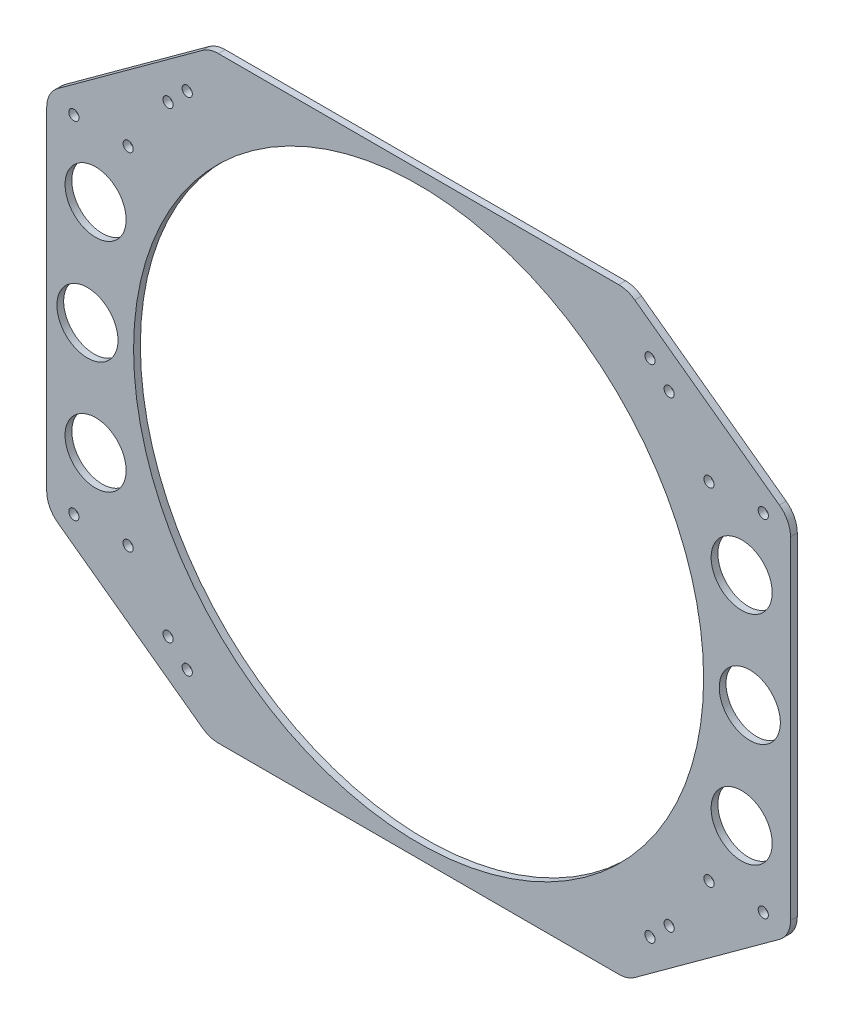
ISO-10303-21;
HEADER;
FILE_DESCRIPTION(('STEP AP214'),'2;1');
FILE_NAME('part.step','',(''),(''),'','','');
FILE_SCHEMA(('AUTOMOTIVE_DESIGN { 1 0 10303 214 1 1 1 1 }'));
ENDSEC;
DATA;
#1=APPLICATION_CONTEXT('core data for automotive mechanical design processes');
#2=APPLICATION_PROTOCOL_DEFINITION('international standard','automotive_design',2000,#1);
#3=PRODUCT_CONTEXT('',#1,'mechanical');
#4=PRODUCT('Part','Part','',(#3));
#5=PRODUCT_RELATED_PRODUCT_CATEGORY('part','',(#4));
#6=PRODUCT_DEFINITION_FORMATION('','',#4);
#7=PRODUCT_DEFINITION_CONTEXT('part definition',#1,'design');
#8=PRODUCT_DEFINITION('design','',#6,#7);
#9=PRODUCT_DEFINITION_SHAPE('','',#8);
#10=(LENGTH_UNIT() NAMED_UNIT(*) SI_UNIT(.MILLI.,.METRE.));
#11=(NAMED_UNIT(*) PLANE_ANGLE_UNIT() SI_UNIT($,.RADIAN.));
#12=(NAMED_UNIT(*) SI_UNIT($,.STERADIAN.) SOLID_ANGLE_UNIT());
#13=UNCERTAINTY_MEASURE_WITH_UNIT(LENGTH_MEASURE(1.E-05),#10,'distance_accuracy_value','');
#14=(GEOMETRIC_REPRESENTATION_CONTEXT(3) GLOBAL_UNCERTAINTY_ASSIGNED_CONTEXT((#13)) GLOBAL_UNIT_ASSIGNED_CONTEXT((#10,
#11,#12)) REPRESENTATION_CONTEXT('',''));
#15=CARTESIAN_POINT('',(0.,0.,0.));
#16=DIRECTION('',(0.,0.,1.));
#17=DIRECTION('',(1.,0.,0.));
#18=AXIS2_PLACEMENT_3D('',#15,#16,#17);
#19=CARTESIAN_POINT('',(-173.99,0.,-3.175));
#20=DIRECTION('',(-1.,0.,0.));
#21=DIRECTION('',(0.,0.,1.));
#22=AXIS2_PLACEMENT_3D('',#19,#20,#21);
#23=PLANE('',#22);
#24=DIRECTION('',(0.,-1.,0.));
#25=VECTOR('',#24,1.);
#26=CARTESIAN_POINT('',(-173.99,0.,0.));
#27=LINE('',#26,#25);
#28=CARTESIAN_POINT('',(-173.99,-61.9606088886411,0.));
#29=VERTEX_POINT('',#28);
#30=CARTESIAN_POINT('',(-173.99,-217.439391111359,0.));
#31=VERTEX_POINT('',#30);
#32=EDGE_CURVE('E205',#29,#31,#27,.T.);
#33=ORIENTED_EDGE('',*,*,#32,.F.);
#34=DIRECTION('',(0.,0.,-1.));
#35=VECTOR('',#34,1.);
#36=CARTESIAN_POINT('',(-173.99,-61.9606088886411,-3.175));
#37=LINE('',#36,#35);
#38=CARTESIAN_POINT('',(-173.99,-61.9606088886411,-3.175));
#39=VERTEX_POINT('',#38);
#40=EDGE_CURVE('E282',#29,#39,#37,.T.);
#41=ORIENTED_EDGE('',*,*,#40,.T.);
#42=DIRECTION('',(0.,-1.,0.));
#43=VECTOR('',#42,1.);
#44=CARTESIAN_POINT('',(-173.99,0.,-3.175));
#45=LINE('',#44,#43);
#46=CARTESIAN_POINT('',(-173.99,-217.439391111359,-3.175));
#47=VERTEX_POINT('',#46);
#48=EDGE_CURVE('E208',#39,#47,#45,.T.);
#49=ORIENTED_EDGE('',*,*,#48,.T.);
#50=DIRECTION('',(0.,0.,-1.));
#51=VECTOR('',#50,1.);
#52=CARTESIAN_POINT('',(-173.99,-217.439391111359,0.));
#53=LINE('',#52,#51);
#54=EDGE_CURVE('E280',#47,#31,#53,.F.);
#55=ORIENTED_EDGE('',*,*,#54,.T.);
#56=EDGE_LOOP('',(#33,#41,#49,#55));
#57=FACE_BOUND('',#56,.T.);
#58=ADVANCED_FACE('F37',(#57),#23,.T.);
#59=CARTESIAN_POINT('',(-173.99,0.,-3.175));
#60=DIRECTION('',(0.,1.,0.));
#61=DIRECTION('',(-1.,0.,0.));
#62=AXIS2_PLACEMENT_3D('',#59,#60,#61);
#63=PLANE('',#62);
#64=DIRECTION('',(-1.,0.,0.));
#65=VECTOR('',#64,1.);
#66=CARTESIAN_POINT('',(-173.99,0.,0.));
#67=LINE('',#66,#65);
#68=CARTESIAN_POINT('',(93.655296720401,0.,0.));
#69=VERTEX_POINT('',#68);
#70=CARTESIAN_POINT('',(-93.6552967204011,0.,0.));
#71=VERTEX_POINT('',#70);
#72=EDGE_CURVE('E212',#69,#71,#67,.T.);
#73=ORIENTED_EDGE('',*,*,#72,.F.);
#74=DIRECTION('',(0.,0.,-1.));
#75=VECTOR('',#74,1.);
#76=CARTESIAN_POINT('',(93.655296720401,0.,-3.175));
#77=LINE('',#76,#75);
#78=CARTESIAN_POINT('',(93.655296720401,0.,-3.175));
#79=VERTEX_POINT('',#78);
#80=EDGE_CURVE('E272',#69,#79,#77,.T.);
#81=ORIENTED_EDGE('',*,*,#80,.T.);
#82=DIRECTION('',(-1.,0.,0.));
#83=VECTOR('',#82,1.);
#84=CARTESIAN_POINT('',(-173.99,0.,-3.175));
#85=LINE('',#84,#83);
#86=CARTESIAN_POINT('',(-93.6552967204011,0.,-3.175));
#87=VERTEX_POINT('',#86);
#88=EDGE_CURVE('E217',#79,#87,#85,.T.);
#89=ORIENTED_EDGE('',*,*,#88,.T.);
#90=DIRECTION('',(0.,0.,-1.));
#91=VECTOR('',#90,1.);
#92=CARTESIAN_POINT('',(-93.6552967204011,0.,0.));
#93=LINE('',#92,#91);
#94=EDGE_CURVE('E270',#87,#71,#93,.F.);
#95=ORIENTED_EDGE('',*,*,#94,.T.);
#96=EDGE_LOOP('',(#73,#81,#89,#95));
#97=FACE_BOUND('',#96,.T.);
#98=ADVANCED_FACE('F322',(#97),#63,.T.);
#99=CARTESIAN_POINT('',(173.99,-279.4,-3.175));
#100=DIRECTION('',(1.,0.,0.));
#101=DIRECTION('',(0.,1.,0.));
#102=AXIS2_PLACEMENT_3D('',#99,#100,#101);
#103=PLANE('',#102);
#104=DIRECTION('',(0.,1.,0.));
#105=VECTOR('',#104,1.);
#106=CARTESIAN_POINT('',(173.99,-279.4,0.));
#107=LINE('',#106,#105);
#108=CARTESIAN_POINT('',(173.99,-217.439391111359,0.));
#109=VERTEX_POINT('',#108);
#110=CARTESIAN_POINT('',(173.99,-61.9606088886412,0.));
#111=VERTEX_POINT('',#110);
#112=EDGE_CURVE('E224',#109,#111,#107,.T.);
#113=ORIENTED_EDGE('',*,*,#112,.F.);
#114=DIRECTION('',(0.,0.,-1.));
#115=VECTOR('',#114,1.);
#116=CARTESIAN_POINT('',(173.99,-217.439391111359,-3.175));
#117=LINE('',#116,#115);
#118=CARTESIAN_POINT('',(173.99,-217.439391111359,-3.175));
#119=VERTEX_POINT('',#118);
#120=EDGE_CURVE('E262',#109,#119,#117,.T.);
#121=ORIENTED_EDGE('',*,*,#120,.T.);
#122=DIRECTION('',(0.,1.,0.));
#123=VECTOR('',#122,1.);
#124=CARTESIAN_POINT('',(173.99,-279.4,-3.175));
#125=LINE('',#124,#123);
#126=CARTESIAN_POINT('',(173.99,-61.9606088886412,-3.175));
#127=VERTEX_POINT('',#126);
#128=EDGE_CURVE('E214',#119,#127,#125,.T.);
#129=ORIENTED_EDGE('',*,*,#128,.T.);
#130=DIRECTION('',(0.,0.,-1.));
#131=VECTOR('',#130,1.);
#132=CARTESIAN_POINT('',(173.99,-61.9606088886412,0.));
#133=LINE('',#132,#131);
#134=EDGE_CURVE('E260',#127,#111,#133,.F.);
#135=ORIENTED_EDGE('',*,*,#134,.T.);
#136=EDGE_LOOP('',(#113,#121,#129,#135));
#137=FACE_BOUND('',#136,.T.);
#138=ADVANCED_FACE('F304',(#137),#103,.T.);
#139=CARTESIAN_POINT('',(173.99,-279.4,-3.175));
#140=DIRECTION('',(0.,-1.,0.));
#141=DIRECTION('',(1.,0.,0.));
#142=AXIS2_PLACEMENT_3D('',#139,#140,#141);
#143=PLANE('',#142);
#144=DIRECTION('',(1.,0.,0.));
#145=VECTOR('',#144,1.);
#146=CARTESIAN_POINT('',(173.99,-279.4,-3.175));
#147=LINE('',#146,#145);
#148=CARTESIAN_POINT('',(-93.655296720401,-279.4,-3.175));
#149=VERTEX_POINT('',#148);
#150=CARTESIAN_POINT('',(93.655296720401,-279.4,-3.175));
#151=VERTEX_POINT('',#150);
#152=EDGE_CURVE('E211',#149,#151,#147,.T.);
#153=ORIENTED_EDGE('',*,*,#152,.T.);
#154=DIRECTION('',(0.,0.,-1.));
#155=VECTOR('',#154,1.);
#156=CARTESIAN_POINT('',(93.655296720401,-279.4,0.));
#157=LINE('',#156,#155);
#158=CARTESIAN_POINT('',(93.655296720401,-279.4,0.));
#159=VERTEX_POINT('',#158);
#160=EDGE_CURVE('E155',#151,#159,#157,.F.);
#161=ORIENTED_EDGE('',*,*,#160,.T.);
#162=DIRECTION('',(1.,0.,0.));
#163=VECTOR('',#162,1.);
#164=CARTESIAN_POINT('',(173.99,-279.4,0.));
#165=LINE('',#164,#163);
#166=CARTESIAN_POINT('',(-93.655296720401,-279.4,0.));
#167=VERTEX_POINT('',#166);
#168=EDGE_CURVE('E221',#167,#159,#165,.T.);
#169=ORIENTED_EDGE('',*,*,#168,.F.);
#170=DIRECTION('',(0.,0.,-1.));
#171=VECTOR('',#170,1.);
#172=CARTESIAN_POINT('',(-93.655296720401,-279.4,-3.175));
#173=LINE('',#172,#171);
#174=EDGE_CURVE('E160',#167,#149,#173,.T.);
#175=ORIENTED_EDGE('',*,*,#174,.T.);
#176=EDGE_LOOP('',(#153,#161,#169,#175));
#177=FACE_BOUND('',#176,.T.);
#178=ADVANCED_FACE('F296',(#177),#143,.T.);
#179=CARTESIAN_POINT('',(0.,0.,-3.175));
#180=DIRECTION('',(0.,0.,-1.));
#181=DIRECTION('',(-1.,0.,0.));
#182=AXIS2_PLACEMENT_3D('',#179,#180,#181);
#183=PLANE('',#182);
#184=CARTESIAN_POINT('',(151.13,-88.8999999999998,-3.175));
#185=DIRECTION('',(0.,0.,1.));
#186=DIRECTION('',(-1.,0.,0.));
#187=AXIS2_PLACEMENT_3D('',#184,#185,#186);
#188=CIRCLE('',#187,14.2875);
#189=CARTESIAN_POINT('',(136.8425,-88.8999999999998,-3.175));
#190=VERTEX_POINT('',#189);
#191=EDGE_CURVE('E775',#190,#190,#188,.T.);
#192=ORIENTED_EDGE('',*,*,#191,.T.);
#193=EDGE_LOOP('',(#192));
#194=FACE_BOUND('',#193,.T.);
#195=CARTESIAN_POINT('',(154.94,-139.7,-3.175));
#196=DIRECTION('',(0.,0.,1.));
#197=DIRECTION('',(-1.,0.,0.));
#198=AXIS2_PLACEMENT_3D('',#195,#196,#197);
#199=CIRCLE('',#198,14.2875);
#200=CARTESIAN_POINT('',(140.6525,-139.7,-3.175));
#201=VERTEX_POINT('',#200);
#202=EDGE_CURVE('E779',#201,#201,#199,.T.);
#203=ORIENTED_EDGE('',*,*,#202,.T.);
#204=EDGE_LOOP('',(#203));
#205=FACE_BOUND('',#204,.T.);
#206=CARTESIAN_POINT('',(151.13,-190.5,-3.175));
#207=DIRECTION('',(0.,0.,1.));
#208=DIRECTION('',(-1.,0.,0.));
#209=AXIS2_PLACEMENT_3D('',#206,#207,#208);
#210=CIRCLE('',#209,14.2875);
#211=CARTESIAN_POINT('',(136.8425,-190.5,-3.175));
#212=VERTEX_POINT('',#211);
#213=EDGE_CURVE('E783',#212,#212,#210,.T.);
#214=ORIENTED_EDGE('',*,*,#213,.T.);
#215=EDGE_LOOP('',(#214));
#216=FACE_BOUND('',#215,.T.);
#217=CARTESIAN_POINT('',(-151.13,-190.5,-3.175));
#218=DIRECTION('',(0.,0.,1.));
#219=DIRECTION('',(1.,0.,0.));
#220=AXIS2_PLACEMENT_3D('',#217,#218,#219);
#221=CIRCLE('',#220,14.2875);
#222=CARTESIAN_POINT('',(-136.8425,-190.5,-3.175));
#223=VERTEX_POINT('',#222);
#224=EDGE_CURVE('E787',#223,#223,#221,.T.);
#225=ORIENTED_EDGE('',*,*,#224,.T.);
#226=EDGE_LOOP('',(#225));
#227=FACE_BOUND('',#226,.T.);
#228=CARTESIAN_POINT('',(-154.94,-139.7,-3.175));
#229=DIRECTION('',(0.,0.,1.));
#230=DIRECTION('',(1.,0.,0.));
#231=AXIS2_PLACEMENT_3D('',#228,#229,#230);
#232=CIRCLE('',#231,14.2875);
#233=CARTESIAN_POINT('',(-140.6525,-139.7,-3.175));
#234=VERTEX_POINT('',#233);
#235=EDGE_CURVE('E791',#234,#234,#232,.T.);
#236=ORIENTED_EDGE('',*,*,#235,.T.);
#237=EDGE_LOOP('',(#236));
#238=FACE_BOUND('',#237,.T.);
#239=CARTESIAN_POINT('',(-151.13,-88.8999999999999,-3.175));
#240=DIRECTION('',(0.,0.,1.));
#241=DIRECTION('',(1.,0.,0.));
#242=AXIS2_PLACEMENT_3D('',#239,#240,#241);
#243=CIRCLE('',#242,14.2875);
#244=CARTESIAN_POINT('',(-136.8425,-88.8999999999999,-3.175));
#245=VERTEX_POINT('',#244);
#246=EDGE_CURVE('E795',#245,#245,#243,.T.);
#247=ORIENTED_EDGE('',*,*,#246,.T.);
#248=EDGE_LOOP('',(#247));
#249=FACE_BOUND('',#248,.T.);
#250=CARTESIAN_POINT('',(108.243517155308,-256.923773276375,-3.175));
#251=DIRECTION('',(0.,0.,-1.));
#252=DIRECTION('',(0.,1.,0.));
#253=AXIS2_PLACEMENT_3D('',#250,#251,#252);
#254=CIRCLE('',#253,2.38125000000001);
#255=CARTESIAN_POINT('',(108.243517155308,-254.542523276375,-3.175));
#256=VERTEX_POINT('',#255);
#257=EDGE_CURVE('E799',#256,#256,#254,.T.);
#258=ORIENTED_EDGE('',*,*,#257,.F.);
#259=EDGE_LOOP('',(#258));
#260=FACE_BOUND('',#259,.T.);
#261=CARTESIAN_POINT('',(117.223773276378,-247.943517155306,-3.175));
#262=DIRECTION('',(0.,0.,-1.));
#263=DIRECTION('',(0.,1.,0.));
#264=AXIS2_PLACEMENT_3D('',#261,#262,#263);
#265=CIRCLE('',#264,2.38125000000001);
#266=CARTESIAN_POINT('',(117.223773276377,-245.562267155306,-3.175));
#267=VERTEX_POINT('',#266);
#268=EDGE_CURVE('E803',#267,#267,#265,.T.);
#269=ORIENTED_EDGE('',*,*,#268,.F.);
#270=EDGE_LOOP('',(#269));
#271=FACE_BOUND('',#270,.T.);
#272=CARTESIAN_POINT('',(-117.223773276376,-247.943517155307,-3.175));
#273=DIRECTION('',(0.,0.,-1.));
#274=DIRECTION('',(1.,0.,0.));
#275=AXIS2_PLACEMENT_3D('',#272,#273,#274);
#276=CIRCLE('',#275,2.38125000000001);
#277=CARTESIAN_POINT('',(-114.842523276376,-247.943517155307,-3.175));
#278=VERTEX_POINT('',#277);
#279=EDGE_CURVE('E807',#278,#278,#276,.T.);
#280=ORIENTED_EDGE('',*,*,#279,.F.);
#281=EDGE_LOOP('',(#280));
#282=FACE_BOUND('',#281,.T.);
#283=CARTESIAN_POINT('',(-108.243517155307,-256.923773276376,-3.175));
#284=DIRECTION('',(0.,0.,-1.));
#285=DIRECTION('',(1.,0.,0.));
#286=AXIS2_PLACEMENT_3D('',#283,#284,#285);
#287=CIRCLE('',#286,2.38125000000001);
#288=CARTESIAN_POINT('',(-105.862267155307,-256.923773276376,-3.175));
#289=VERTEX_POINT('',#288);
#290=EDGE_CURVE('E811',#289,#289,#287,.T.);
#291=ORIENTED_EDGE('',*,*,#290,.F.);
#292=EDGE_LOOP('',(#291));
#293=FACE_BOUND('',#292,.T.);
#294=CARTESIAN_POINT('',(-108.243517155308,-22.4762267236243,-3.175));
#295=DIRECTION('',(0.,0.,-1.));
#296=DIRECTION('',(0.,-1.,0.));
#297=AXIS2_PLACEMENT_3D('',#294,#295,#296);
#298=CIRCLE('',#297,2.38125000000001);
#299=CARTESIAN_POINT('',(-108.243517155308,-24.8574767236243,-3.175));
#300=VERTEX_POINT('',#299);
#301=EDGE_CURVE('E815',#300,#300,#298,.T.);
#302=ORIENTED_EDGE('',*,*,#301,.F.);
#303=EDGE_LOOP('',(#302));
#304=FACE_BOUND('',#303,.T.);
#305=CARTESIAN_POINT('',(-117.223773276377,-31.4564828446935,-3.175));
#306=DIRECTION('',(0.,0.,-1.));
#307=DIRECTION('',(0.,-1.,0.));
#308=AXIS2_PLACEMENT_3D('',#305,#306,#307);
#309=CIRCLE('',#308,2.38125000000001);
#310=CARTESIAN_POINT('',(-117.223773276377,-33.8377328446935,-3.175));
#311=VERTEX_POINT('',#310);
#312=EDGE_CURVE('E819',#311,#311,#309,.T.);
#313=ORIENTED_EDGE('',*,*,#312,.F.);
#314=EDGE_LOOP('',(#313));
#315=FACE_BOUND('',#314,.T.);
#316=CARTESIAN_POINT('',(117.223773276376,-31.4564828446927,-3.175));
#317=DIRECTION('',(0.,0.,-1.));
#318=DIRECTION('',(-1.,0.,0.));
#319=AXIS2_PLACEMENT_3D('',#316,#317,#318);
#320=CIRCLE('',#319,2.38125000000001);
#321=CARTESIAN_POINT('',(114.842523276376,-31.4564828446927,-3.175));
#322=VERTEX_POINT('',#321);
#323=EDGE_CURVE('E823',#322,#322,#320,.T.);
#324=ORIENTED_EDGE('',*,*,#323,.F.);
#325=EDGE_LOOP('',(#324));
#326=FACE_BOUND('',#325,.T.);
#327=CARTESIAN_POINT('',(108.243517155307,-22.4762267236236,-3.175));
#328=DIRECTION('',(0.,0.,-1.));
#329=DIRECTION('',(-1.,0.,0.));
#330=AXIS2_PLACEMENT_3D('',#327,#328,#329);
#331=CIRCLE('',#330,2.38125000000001);
#332=CARTESIAN_POINT('',(105.862267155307,-22.4762267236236,-3.175));
#333=VERTEX_POINT('',#332);
#334=EDGE_CURVE('E827',#333,#333,#331,.T.);
#335=ORIENTED_EDGE('',*,*,#334,.F.);
#336=EDGE_LOOP('',(#335));
#337=FACE_BOUND('',#336,.T.);
#338=CARTESIAN_POINT('',(161.260000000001,-220.472,-3.175));
#339=DIRECTION('',(0.,0.,-1.));
#340=DIRECTION('',(-1.,0.,0.));
#341=AXIS2_PLACEMENT_3D('',#338,#339,#340);
#342=CIRCLE('',#341,2.38125);
#343=CARTESIAN_POINT('',(158.878750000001,-220.472,-3.175));
#344=VERTEX_POINT('',#343);
#345=EDGE_CURVE('E831',#344,#344,#342,.T.);
#346=ORIENTED_EDGE('',*,*,#345,.F.);
#347=EDGE_LOOP('',(#346));
#348=FACE_BOUND('',#347,.T.);
#349=CARTESIAN_POINT('',(135.860000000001,-220.472,-3.175));
#350=DIRECTION('',(0.,0.,-1.));
#351=DIRECTION('',(-1.,0.,0.));
#352=AXIS2_PLACEMENT_3D('',#349,#350,#351);
#353=CIRCLE('',#352,2.38125);
#354=CARTESIAN_POINT('',(133.478750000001,-220.472,-3.175));
#355=VERTEX_POINT('',#354);
#356=EDGE_CURVE('E835',#355,#355,#353,.T.);
#357=ORIENTED_EDGE('',*,*,#356,.F.);
#358=EDGE_LOOP('',(#357));
#359=FACE_BOUND('',#358,.T.);
#360=CARTESIAN_POINT('',(161.260000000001,-58.674,-3.175));
#361=DIRECTION('',(0.,0.,-1.));
#362=DIRECTION('',(-1.,0.,0.));
#363=AXIS2_PLACEMENT_3D('',#360,#361,#362);
#364=CIRCLE('',#363,2.38125);
#365=CARTESIAN_POINT('',(158.878750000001,-58.674,-3.175));
#366=VERTEX_POINT('',#365);
#367=EDGE_CURVE('E839',#366,#366,#364,.T.);
#368=ORIENTED_EDGE('',*,*,#367,.F.);
#369=EDGE_LOOP('',(#368));
#370=FACE_BOUND('',#369,.T.);
#371=CARTESIAN_POINT('',(135.860000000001,-58.674,-3.175));
#372=DIRECTION('',(0.,0.,-1.));
#373=DIRECTION('',(-1.,0.,0.));
#374=AXIS2_PLACEMENT_3D('',#371,#372,#373);
#375=CIRCLE('',#374,2.38125);
#376=CARTESIAN_POINT('',(133.478750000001,-58.674,-3.175));
#377=VERTEX_POINT('',#376);
#378=EDGE_CURVE('E843',#377,#377,#375,.T.);
#379=ORIENTED_EDGE('',*,*,#378,.F.);
#380=EDGE_LOOP('',(#379));
#381=FACE_BOUND('',#380,.T.);
#382=CARTESIAN_POINT('',(-161.289999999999,-58.674,-3.175));
#383=DIRECTION('',(0.,0.,-1.));
#384=DIRECTION('',(-1.,0.,0.));
#385=AXIS2_PLACEMENT_3D('',#382,#383,#384);
#386=CIRCLE('',#385,2.38125);
#387=CARTESIAN_POINT('',(-163.671249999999,-58.674,-3.175));
#388=VERTEX_POINT('',#387);
#389=EDGE_CURVE('E847',#388,#388,#386,.T.);
#390=ORIENTED_EDGE('',*,*,#389,.F.);
#391=EDGE_LOOP('',(#390));
#392=FACE_BOUND('',#391,.T.);
#393=CARTESIAN_POINT('',(-135.889999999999,-58.674,-3.175));
#394=DIRECTION('',(0.,0.,-1.));
#395=DIRECTION('',(-1.,0.,0.));
#396=AXIS2_PLACEMENT_3D('',#393,#394,#395);
#397=CIRCLE('',#396,2.38125);
#398=CARTESIAN_POINT('',(-138.271249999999,-58.674,-3.175));
#399=VERTEX_POINT('',#398);
#400=EDGE_CURVE('E851',#399,#399,#397,.T.);
#401=ORIENTED_EDGE('',*,*,#400,.F.);
#402=EDGE_LOOP('',(#401));
#403=FACE_BOUND('',#402,.T.);
#404=CARTESIAN_POINT('',(-135.889999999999,-220.472,-3.175));
#405=DIRECTION('',(0.,0.,-1.));
#406=DIRECTION('',(-1.,0.,0.));
#407=AXIS2_PLACEMENT_3D('',#404,#405,#406);
#408=CIRCLE('',#407,2.38125);
#409=CARTESIAN_POINT('',(-138.271249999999,-220.472,-3.175));
#410=VERTEX_POINT('',#409);
#411=EDGE_CURVE('E855',#410,#410,#408,.T.);
#412=ORIENTED_EDGE('',*,*,#411,.F.);
#413=EDGE_LOOP('',(#412));
#414=FACE_BOUND('',#413,.T.);
#415=CARTESIAN_POINT('',(-161.289999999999,-220.472,-3.175));
#416=DIRECTION('',(0.,0.,-1.));
#417=DIRECTION('',(-1.,0.,0.));
#418=AXIS2_PLACEMENT_3D('',#415,#416,#417);
#419=CIRCLE('',#418,2.38125);
#420=CARTESIAN_POINT('',(-163.671249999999,-220.472,-3.175));
#421=VERTEX_POINT('',#420);
#422=EDGE_CURVE('E182',#421,#421,#419,.T.);
#423=ORIENTED_EDGE('',*,*,#422,.F.);
#424=EDGE_LOOP('',(#423));
#425=FACE_BOUND('',#424,.T.);
#426=DIRECTION('',(0.808328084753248,0.588732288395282,0.));
#427=VECTOR('',#426,1.);
#428=CARTESIAN_POINT('',(173.99,-223.901,-3.175));
#429=LINE('',#428,#427);
#430=CARTESIAN_POINT('',(101.132196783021,-276.965766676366,-3.175));
#431=VERTEX_POINT('',#430);
#432=CARTESIAN_POINT('',(168.76690006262,-227.705157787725,-3.175));
#433=VERTEX_POINT('',#432);
#434=EDGE_CURVE('E167',#431,#433,#429,.T.);
#435=ORIENTED_EDGE('',*,*,#434,.F.);
#436=CARTESIAN_POINT('',(93.655296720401,-266.7,-3.175));
#437=DIRECTION('',(0.,0.,-1.));
#438=DIRECTION('',(-1.,0.,0.));
#439=AXIS2_PLACEMENT_3D('',#436,#437,#438);
#440=CIRCLE('',#439,12.7);
#441=EDGE_CURVE('E150',#431,#151,#440,.T.);
#442=ORIENTED_EDGE('',*,*,#441,.T.);
#443=ORIENTED_EDGE('',*,*,#152,.F.);
#444=CARTESIAN_POINT('',(-93.655296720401,-266.7,-3.175));
#445=DIRECTION('',(0.,0.,-1.));
#446=DIRECTION('',(-1.,0.,0.));
#447=AXIS2_PLACEMENT_3D('',#444,#445,#446);
#448=CIRCLE('',#447,12.7);
#449=CARTESIAN_POINT('',(-101.132196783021,-276.965766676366,-3.175));
#450=VERTEX_POINT('',#449);
#451=EDGE_CURVE('E231',#149,#450,#448,.T.);
#452=ORIENTED_EDGE('',*,*,#451,.T.);
#453=DIRECTION('',(0.808328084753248,-0.588732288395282,0.));
#454=VECTOR('',#453,1.);
#455=CARTESIAN_POINT('',(-173.99,-223.901,-3.175));
#456=LINE('',#455,#454);
#457=CARTESIAN_POINT('',(-168.76690006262,-227.705157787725,-3.175));
#458=VERTEX_POINT('',#457);
#459=EDGE_CURVE('E179',#458,#450,#456,.T.);
#460=ORIENTED_EDGE('',*,*,#459,.F.);
#461=CARTESIAN_POINT('',(-161.29,-217.439391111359,-3.175));
#462=DIRECTION('',(0.,0.,-1.));
#463=DIRECTION('',(-1.,0.,0.));
#464=AXIS2_PLACEMENT_3D('',#461,#462,#463);
#465=CIRCLE('',#464,12.7);
#466=EDGE_CURVE('E171',#458,#47,#465,.T.);
#467=ORIENTED_EDGE('',*,*,#466,.T.);
#468=ORIENTED_EDGE('',*,*,#48,.F.);
#469=CARTESIAN_POINT('',(-161.29,-61.9606088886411,-3.175));
#470=DIRECTION('',(0.,0.,-1.));
#471=DIRECTION('',(-1.,0.,0.));
#472=AXIS2_PLACEMENT_3D('',#469,#470,#471);
#473=CIRCLE('',#472,12.7);
#474=CARTESIAN_POINT('',(-168.76690006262,-51.6948422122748,-3.175));
#475=VERTEX_POINT('',#474);
#476=EDGE_CURVE('E233',#39,#475,#473,.T.);
#477=ORIENTED_EDGE('',*,*,#476,.T.);
#478=DIRECTION('',(-0.808328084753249,-0.588732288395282,0.));
#479=VECTOR('',#478,1.);
#480=CARTESIAN_POINT('',(-173.99,-55.4989999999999,-3.175));
#481=LINE('',#480,#479);
#482=CARTESIAN_POINT('',(-101.132196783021,-2.43423332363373,-3.175));
#483=VERTEX_POINT('',#482);
#484=EDGE_CURVE('E188',#483,#475,#481,.T.);
#485=ORIENTED_EDGE('',*,*,#484,.F.);
#486=CARTESIAN_POINT('',(-93.6552967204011,-12.7,-3.175));
#487=DIRECTION('',(0.,0.,-1.));
#488=DIRECTION('',(-1.,0.,0.));
#489=AXIS2_PLACEMENT_3D('',#486,#487,#488);
#490=CIRCLE('',#489,12.7);
#491=EDGE_CURVE('E235',#483,#87,#490,.T.);
#492=ORIENTED_EDGE('',*,*,#491,.T.);
#493=ORIENTED_EDGE('',*,*,#88,.F.);
#494=CARTESIAN_POINT('',(93.655296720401,-12.7,-3.175));
#495=DIRECTION('',(0.,0.,-1.));
#496=DIRECTION('',(-1.,0.,0.));
#497=AXIS2_PLACEMENT_3D('',#494,#495,#496);
#498=CIRCLE('',#497,12.7);
#499=CARTESIAN_POINT('',(101.132196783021,-2.4342333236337,-3.175));
#500=VERTEX_POINT('',#499);
#501=EDGE_CURVE('E237',#79,#500,#498,.T.);
#502=ORIENTED_EDGE('',*,*,#501,.T.);
#503=DIRECTION('',(-0.808328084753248,0.588732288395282,0.));
#504=VECTOR('',#503,1.);
#505=CARTESIAN_POINT('',(173.99,-55.4989999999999,-3.175));
#506=LINE('',#505,#504);
#507=CARTESIAN_POINT('',(168.76690006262,-51.6948422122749,-3.175));
#508=VERTEX_POINT('',#507);
#509=EDGE_CURVE('E193',#508,#500,#506,.T.);
#510=ORIENTED_EDGE('',*,*,#509,.F.);
#511=CARTESIAN_POINT('',(161.29,-61.9606088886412,-3.175));
#512=DIRECTION('',(0.,0.,-1.));
#513=DIRECTION('',(-1.,0.,0.));
#514=AXIS2_PLACEMENT_3D('',#511,#512,#513);
#515=CIRCLE('',#514,12.7);
#516=EDGE_CURVE('E239',#508,#127,#515,.T.);
#517=ORIENTED_EDGE('',*,*,#516,.T.);
#518=ORIENTED_EDGE('',*,*,#128,.F.);
#519=CARTESIAN_POINT('',(161.29,-217.439391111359,-3.175));
#520=DIRECTION('',(0.,0.,-1.));
#521=DIRECTION('',(-1.,0.,0.));
#522=AXIS2_PLACEMENT_3D('',#519,#520,#521);
#523=CIRCLE('',#522,12.7);
#524=EDGE_CURVE('E161',#119,#433,#523,.T.);
#525=ORIENTED_EDGE('',*,*,#524,.T.);
#526=EDGE_LOOP('',(#435,#442,#443,#452,#460,#467,#468,#477,#485,#492,#493,#502,#510,#517,#518,#525));
#527=FACE_BOUND('',#526,.T.);
#528=CARTESIAN_POINT('',(0.,-139.7,-3.175));
#529=DIRECTION('',(0.,0.,1.));
#530=DIRECTION('',(1.,0.,0.));
#531=AXIS2_PLACEMENT_3D('',#528,#529,#530);
#532=CIRCLE('',#531,133.35);
#533=CARTESIAN_POINT('',(133.35,-139.7,-3.175));
#534=VERTEX_POINT('',#533);
#535=EDGE_CURVE('E202',#534,#534,#532,.T.);
#536=ORIENTED_EDGE('',*,*,#535,.T.);
#537=EDGE_LOOP('',(#536));
#538=FACE_BOUND('',#537,.T.);
#539=ADVANCED_FACE('F174',(#194,#205,#216,#227,#238,#249,#260,#271,#282,#293,#304,#315,#326,
#337,#348,#359,#370,#381,#392,#403,#414,#425,#527,#538),#183,.T.);
#540=CARTESIAN_POINT('',(0.,0.,0.));
#541=DIRECTION('',(0.,0.,-1.));
#542=DIRECTION('',(-1.,0.,0.));
#543=AXIS2_PLACEMENT_3D('',#540,#541,#542);
#544=PLANE('',#543);
#545=CARTESIAN_POINT('',(151.13,-88.8999999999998,0.));
#546=DIRECTION('',(0.,0.,1.));
#547=DIRECTION('',(-1.,0.,0.));
#548=AXIS2_PLACEMENT_3D('',#545,#546,#547);
#549=CIRCLE('',#548,14.2875);
#550=CARTESIAN_POINT('',(136.8425,-88.8999999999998,0.));
#551=VERTEX_POINT('',#550);
#552=EDGE_CURVE('E940',#551,#551,#549,.T.);
#553=ORIENTED_EDGE('',*,*,#552,.F.);
#554=EDGE_LOOP('',(#553));
#555=FACE_BOUND('',#554,.T.);
#556=CARTESIAN_POINT('',(154.94,-139.7,0.));
#557=DIRECTION('',(0.,0.,1.));
#558=DIRECTION('',(-1.,0.,0.));
#559=AXIS2_PLACEMENT_3D('',#556,#557,#558);
#560=CIRCLE('',#559,14.2875);
#561=CARTESIAN_POINT('',(140.6525,-139.7,0.));
#562=VERTEX_POINT('',#561);
#563=EDGE_CURVE('E936',#562,#562,#560,.T.);
#564=ORIENTED_EDGE('',*,*,#563,.F.);
#565=EDGE_LOOP('',(#564));
#566=FACE_BOUND('',#565,.T.);
#567=CARTESIAN_POINT('',(151.13,-190.5,0.));
#568=DIRECTION('',(0.,0.,1.));
#569=DIRECTION('',(-1.,0.,0.));
#570=AXIS2_PLACEMENT_3D('',#567,#568,#569);
#571=CIRCLE('',#570,14.2875);
#572=CARTESIAN_POINT('',(136.8425,-190.5,0.));
#573=VERTEX_POINT('',#572);
#574=EDGE_CURVE('E932',#573,#573,#571,.T.);
#575=ORIENTED_EDGE('',*,*,#574,.F.);
#576=EDGE_LOOP('',(#575));
#577=FACE_BOUND('',#576,.T.);
#578=CARTESIAN_POINT('',(-151.13,-190.5,0.));
#579=DIRECTION('',(0.,0.,1.));
#580=DIRECTION('',(1.,0.,0.));
#581=AXIS2_PLACEMENT_3D('',#578,#579,#580);
#582=CIRCLE('',#581,14.2875);
#583=CARTESIAN_POINT('',(-136.8425,-190.5,0.));
#584=VERTEX_POINT('',#583);
#585=EDGE_CURVE('E928',#584,#584,#582,.T.);
#586=ORIENTED_EDGE('',*,*,#585,.F.);
#587=EDGE_LOOP('',(#586));
#588=FACE_BOUND('',#587,.T.);
#589=CARTESIAN_POINT('',(-154.94,-139.7,0.));
#590=DIRECTION('',(0.,0.,1.));
#591=DIRECTION('',(1.,0.,0.));
#592=AXIS2_PLACEMENT_3D('',#589,#590,#591);
#593=CIRCLE('',#592,14.2875);
#594=CARTESIAN_POINT('',(-140.6525,-139.7,0.));
#595=VERTEX_POINT('',#594);
#596=EDGE_CURVE('E924',#595,#595,#593,.T.);
#597=ORIENTED_EDGE('',*,*,#596,.F.);
#598=EDGE_LOOP('',(#597));
#599=FACE_BOUND('',#598,.T.);
#600=CARTESIAN_POINT('',(-151.13,-88.8999999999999,0.));
#601=DIRECTION('',(0.,0.,1.));
#602=DIRECTION('',(1.,0.,0.));
#603=AXIS2_PLACEMENT_3D('',#600,#601,#602);
#604=CIRCLE('',#603,14.2875);
#605=CARTESIAN_POINT('',(-136.8425,-88.8999999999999,0.));
#606=VERTEX_POINT('',#605);
#607=EDGE_CURVE('E920',#606,#606,#604,.T.);
#608=ORIENTED_EDGE('',*,*,#607,.F.);
#609=EDGE_LOOP('',(#608));
#610=FACE_BOUND('',#609,.T.);
#611=CARTESIAN_POINT('',(108.243517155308,-256.923773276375,0.));
#612=DIRECTION('',(0.,0.,-1.));
#613=DIRECTION('',(0.,1.,0.));
#614=AXIS2_PLACEMENT_3D('',#611,#612,#613);
#615=CIRCLE('',#614,2.38125000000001);
#616=CARTESIAN_POINT('',(108.243517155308,-254.542523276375,0.));
#617=VERTEX_POINT('',#616);
#618=EDGE_CURVE('E914',#617,#617,#615,.T.);
#619=ORIENTED_EDGE('',*,*,#618,.T.);
#620=EDGE_LOOP('',(#619));
#621=FACE_BOUND('',#620,.T.);
#622=CARTESIAN_POINT('',(117.223773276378,-247.943517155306,0.));
#623=DIRECTION('',(0.,0.,-1.));
#624=DIRECTION('',(0.,1.,0.));
#625=AXIS2_PLACEMENT_3D('',#622,#623,#624);
#626=CIRCLE('',#625,2.38125000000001);
#627=CARTESIAN_POINT('',(117.223773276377,-245.562267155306,0.));
#628=VERTEX_POINT('',#627);
#629=EDGE_CURVE('E910',#628,#628,#626,.T.);
#630=ORIENTED_EDGE('',*,*,#629,.T.);
#631=EDGE_LOOP('',(#630));
#632=FACE_BOUND('',#631,.T.);
#633=CARTESIAN_POINT('',(-117.223773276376,-247.943517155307,0.));
#634=DIRECTION('',(0.,0.,-1.));
#635=DIRECTION('',(1.,0.,0.));
#636=AXIS2_PLACEMENT_3D('',#633,#634,#635);
#637=CIRCLE('',#636,2.38125000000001);
#638=CARTESIAN_POINT('',(-114.842523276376,-247.943517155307,0.));
#639=VERTEX_POINT('',#638);
#640=EDGE_CURVE('E906',#639,#639,#637,.T.);
#641=ORIENTED_EDGE('',*,*,#640,.T.);
#642=EDGE_LOOP('',(#641));
#643=FACE_BOUND('',#642,.T.);
#644=CARTESIAN_POINT('',(-108.243517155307,-256.923773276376,0.));
#645=DIRECTION('',(0.,0.,-1.));
#646=DIRECTION('',(1.,0.,0.));
#647=AXIS2_PLACEMENT_3D('',#644,#645,#646);
#648=CIRCLE('',#647,2.38125000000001);
#649=CARTESIAN_POINT('',(-105.862267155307,-256.923773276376,0.));
#650=VERTEX_POINT('',#649);
#651=EDGE_CURVE('E902',#650,#650,#648,.T.);
#652=ORIENTED_EDGE('',*,*,#651,.T.);
#653=EDGE_LOOP('',(#652));
#654=FACE_BOUND('',#653,.T.);
#655=CARTESIAN_POINT('',(-108.243517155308,-22.4762267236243,0.));
#656=DIRECTION('',(0.,0.,-1.));
#657=DIRECTION('',(0.,-1.,0.));
#658=AXIS2_PLACEMENT_3D('',#655,#656,#657);
#659=CIRCLE('',#658,2.38125000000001);
#660=CARTESIAN_POINT('',(-108.243517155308,-24.8574767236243,0.));
#661=VERTEX_POINT('',#660);
#662=EDGE_CURVE('E898',#661,#661,#659,.T.);
#663=ORIENTED_EDGE('',*,*,#662,.T.);
#664=EDGE_LOOP('',(#663));
#665=FACE_BOUND('',#664,.T.);
#666=CARTESIAN_POINT('',(-117.223773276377,-31.4564828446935,0.));
#667=DIRECTION('',(0.,0.,-1.));
#668=DIRECTION('',(0.,-1.,0.));
#669=AXIS2_PLACEMENT_3D('',#666,#667,#668);
#670=CIRCLE('',#669,2.38125000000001);
#671=CARTESIAN_POINT('',(-117.223773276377,-33.8377328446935,0.));
#672=VERTEX_POINT('',#671);
#673=EDGE_CURVE('E894',#672,#672,#670,.T.);
#674=ORIENTED_EDGE('',*,*,#673,.T.);
#675=EDGE_LOOP('',(#674));
#676=FACE_BOUND('',#675,.T.);
#677=CARTESIAN_POINT('',(117.223773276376,-31.4564828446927,0.));
#678=DIRECTION('',(0.,0.,-1.));
#679=DIRECTION('',(-1.,0.,0.));
#680=AXIS2_PLACEMENT_3D('',#677,#678,#679);
#681=CIRCLE('',#680,2.38125000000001);
#682=CARTESIAN_POINT('',(114.842523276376,-31.4564828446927,0.));
#683=VERTEX_POINT('',#682);
#684=EDGE_CURVE('E890',#683,#683,#681,.T.);
#685=ORIENTED_EDGE('',*,*,#684,.T.);
#686=EDGE_LOOP('',(#685));
#687=FACE_BOUND('',#686,.T.);
#688=CARTESIAN_POINT('',(108.243517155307,-22.4762267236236,0.));
#689=DIRECTION('',(0.,0.,-1.));
#690=DIRECTION('',(-1.,0.,0.));
#691=AXIS2_PLACEMENT_3D('',#688,#689,#690);
#692=CIRCLE('',#691,2.38125000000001);
#693=CARTESIAN_POINT('',(105.862267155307,-22.4762267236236,0.));
#694=VERTEX_POINT('',#693);
#695=EDGE_CURVE('E886',#694,#694,#692,.T.);
#696=ORIENTED_EDGE('',*,*,#695,.T.);
#697=EDGE_LOOP('',(#696));
#698=FACE_BOUND('',#697,.T.);
#699=CARTESIAN_POINT('',(161.260000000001,-220.472,0.));
#700=DIRECTION('',(0.,0.,-1.));
#701=DIRECTION('',(-1.,0.,0.));
#702=AXIS2_PLACEMENT_3D('',#699,#700,#701);
#703=CIRCLE('',#702,2.38125);
#704=CARTESIAN_POINT('',(158.878750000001,-220.472,0.));
#705=VERTEX_POINT('',#704);
#706=EDGE_CURVE('E882',#705,#705,#703,.T.);
#707=ORIENTED_EDGE('',*,*,#706,.T.);
#708=EDGE_LOOP('',(#707));
#709=FACE_BOUND('',#708,.T.);
#710=CARTESIAN_POINT('',(135.860000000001,-220.472,0.));
#711=DIRECTION('',(0.,0.,-1.));
#712=DIRECTION('',(-1.,0.,0.));
#713=AXIS2_PLACEMENT_3D('',#710,#711,#712);
#714=CIRCLE('',#713,2.38125);
#715=CARTESIAN_POINT('',(133.478750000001,-220.472,0.));
#716=VERTEX_POINT('',#715);
#717=EDGE_CURVE('E878',#716,#716,#714,.T.);
#718=ORIENTED_EDGE('',*,*,#717,.T.);
#719=EDGE_LOOP('',(#718));
#720=FACE_BOUND('',#719,.T.);
#721=CARTESIAN_POINT('',(161.260000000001,-58.674,0.));
#722=DIRECTION('',(0.,0.,-1.));
#723=DIRECTION('',(-1.,0.,0.));
#724=AXIS2_PLACEMENT_3D('',#721,#722,#723);
#725=CIRCLE('',#724,2.38125);
#726=CARTESIAN_POINT('',(158.878750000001,-58.674,0.));
#727=VERTEX_POINT('',#726);
#728=EDGE_CURVE('E874',#727,#727,#725,.T.);
#729=ORIENTED_EDGE('',*,*,#728,.T.);
#730=EDGE_LOOP('',(#729));
#731=FACE_BOUND('',#730,.T.);
#732=CARTESIAN_POINT('',(135.860000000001,-58.674,0.));
#733=DIRECTION('',(0.,0.,-1.));
#734=DIRECTION('',(-1.,0.,0.));
#735=AXIS2_PLACEMENT_3D('',#732,#733,#734);
#736=CIRCLE('',#735,2.38125);
#737=CARTESIAN_POINT('',(133.478750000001,-58.674,0.));
#738=VERTEX_POINT('',#737);
#739=EDGE_CURVE('E870',#738,#738,#736,.T.);
#740=ORIENTED_EDGE('',*,*,#739,.T.);
#741=EDGE_LOOP('',(#740));
#742=FACE_BOUND('',#741,.T.);
#743=CARTESIAN_POINT('',(-161.289999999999,-58.674,0.));
#744=DIRECTION('',(0.,0.,-1.));
#745=DIRECTION('',(-1.,0.,0.));
#746=AXIS2_PLACEMENT_3D('',#743,#744,#745);
#747=CIRCLE('',#746,2.38125);
#748=CARTESIAN_POINT('',(-163.671249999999,-58.674,0.));
#749=VERTEX_POINT('',#748);
#750=EDGE_CURVE('E866',#749,#749,#747,.T.);
#751=ORIENTED_EDGE('',*,*,#750,.T.);
#752=EDGE_LOOP('',(#751));
#753=FACE_BOUND('',#752,.T.);
#754=CARTESIAN_POINT('',(-135.889999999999,-58.674,0.));
#755=DIRECTION('',(0.,0.,-1.));
#756=DIRECTION('',(-1.,0.,0.));
#757=AXIS2_PLACEMENT_3D('',#754,#755,#756);
#758=CIRCLE('',#757,2.38125);
#759=CARTESIAN_POINT('',(-138.271249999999,-58.674,0.));
#760=VERTEX_POINT('',#759);
#761=EDGE_CURVE('E863',#760,#760,#758,.T.);
#762=ORIENTED_EDGE('',*,*,#761,.T.);
#763=EDGE_LOOP('',(#762));
#764=FACE_BOUND('',#763,.T.);
#765=CARTESIAN_POINT('',(-135.889999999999,-220.472,0.));
#766=DIRECTION('',(0.,0.,-1.));
#767=DIRECTION('',(-1.,0.,0.));
#768=AXIS2_PLACEMENT_3D('',#765,#766,#767);
#769=CIRCLE('',#768,2.38125);
#770=CARTESIAN_POINT('',(-138.271249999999,-220.472,0.));
#771=VERTEX_POINT('',#770);
#772=EDGE_CURVE('E859',#771,#771,#769,.T.);
#773=ORIENTED_EDGE('',*,*,#772,.T.);
#774=EDGE_LOOP('',(#773));
#775=FACE_BOUND('',#774,.T.);
#776=CARTESIAN_POINT('',(-161.289999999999,-220.472,0.));
#777=DIRECTION('',(0.,0.,-1.));
#778=DIRECTION('',(-1.,0.,0.));
#779=AXIS2_PLACEMENT_3D('',#776,#777,#778);
#780=CIRCLE('',#779,2.38125);
#781=CARTESIAN_POINT('',(-163.671249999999,-220.472,0.));
#782=VERTEX_POINT('',#781);
#783=EDGE_CURVE('E177',#782,#782,#780,.T.);
#784=ORIENTED_EDGE('',*,*,#783,.T.);
#785=EDGE_LOOP('',(#784));
#786=FACE_BOUND('',#785,.T.);
#787=CARTESIAN_POINT('',(0.,-139.7,0.));
#788=DIRECTION('',(0.,0.,1.));
#789=DIRECTION('',(1.,0.,0.));
#790=AXIS2_PLACEMENT_3D('',#787,#788,#789);
#791=CIRCLE('',#790,133.35);
#792=CARTESIAN_POINT('',(133.35,-139.7,0.));
#793=VERTEX_POINT('',#792);
#794=EDGE_CURVE('E199',#793,#793,#791,.T.);
#795=ORIENTED_EDGE('',*,*,#794,.F.);
#796=EDGE_LOOP('',(#795));
#797=FACE_BOUND('',#796,.T.);
#798=ORIENTED_EDGE('',*,*,#168,.T.);
#799=CARTESIAN_POINT('',(93.655296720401,-266.7,0.));
#800=DIRECTION('',(0.,0.,-1.));
#801=DIRECTION('',(-1.,0.,0.));
#802=AXIS2_PLACEMENT_3D('',#799,#800,#801);
#803=CIRCLE('',#802,12.7);
#804=CARTESIAN_POINT('',(101.132196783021,-276.965766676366,0.));
#805=VERTEX_POINT('',#804);
#806=EDGE_CURVE('E258',#159,#805,#803,.F.);
#807=ORIENTED_EDGE('',*,*,#806,.T.);
#808=DIRECTION('',(0.808328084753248,0.588732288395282,0.));
#809=VECTOR('',#808,1.);
#810=CARTESIAN_POINT('',(173.99,-223.901,0.));
#811=LINE('',#810,#809);
#812=CARTESIAN_POINT('',(168.76690006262,-227.705157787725,0.));
#813=VERTEX_POINT('',#812);
#814=EDGE_CURVE('E170',#805,#813,#811,.T.);
#815=ORIENTED_EDGE('',*,*,#814,.T.);
#816=CARTESIAN_POINT('',(161.29,-217.439391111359,0.));
#817=DIRECTION('',(0.,0.,-1.));
#818=DIRECTION('',(-1.,0.,0.));
#819=AXIS2_PLACEMENT_3D('',#816,#817,#818);
#820=CIRCLE('',#819,12.7);
#821=EDGE_CURVE('E256',#813,#109,#820,.F.);
#822=ORIENTED_EDGE('',*,*,#821,.T.);
#823=ORIENTED_EDGE('',*,*,#112,.T.);
#824=CARTESIAN_POINT('',(161.29,-61.9606088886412,0.));
#825=DIRECTION('',(0.,0.,-1.));
#826=DIRECTION('',(-1.,0.,0.));
#827=AXIS2_PLACEMENT_3D('',#824,#825,#826);
#828=CIRCLE('',#827,12.7);
#829=CARTESIAN_POINT('',(168.76690006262,-51.6948422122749,0.));
#830=VERTEX_POINT('',#829);
#831=EDGE_CURVE('E254',#111,#830,#828,.F.);
#832=ORIENTED_EDGE('',*,*,#831,.T.);
#833=DIRECTION('',(-0.808328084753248,0.588732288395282,0.));
#834=VECTOR('',#833,1.);
#835=CARTESIAN_POINT('',(173.99,-55.4989999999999,0.));
#836=LINE('',#835,#834);
#837=CARTESIAN_POINT('',(101.132196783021,-2.4342333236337,0.));
#838=VERTEX_POINT('',#837);
#839=EDGE_CURVE('E196',#830,#838,#836,.T.);
#840=ORIENTED_EDGE('',*,*,#839,.T.);
#841=CARTESIAN_POINT('',(93.655296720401,-12.7,0.));
#842=DIRECTION('',(0.,0.,-1.));
#843=DIRECTION('',(-1.,0.,0.));
#844=AXIS2_PLACEMENT_3D('',#841,#842,#843);
#845=CIRCLE('',#844,12.7);
#846=EDGE_CURVE('E252',#838,#69,#845,.F.);
#847=ORIENTED_EDGE('',*,*,#846,.T.);
#848=ORIENTED_EDGE('',*,*,#72,.T.);
#849=CARTESIAN_POINT('',(-93.6552967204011,-12.7,0.));
#850=DIRECTION('',(0.,0.,-1.));
#851=DIRECTION('',(-1.,0.,0.));
#852=AXIS2_PLACEMENT_3D('',#849,#850,#851);
#853=CIRCLE('',#852,12.7);
#854=CARTESIAN_POINT('',(-101.132196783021,-2.43423332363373,0.));
#855=VERTEX_POINT('',#854);
#856=EDGE_CURVE('E250',#71,#855,#853,.F.);
#857=ORIENTED_EDGE('',*,*,#856,.T.);
#858=DIRECTION('',(-0.808328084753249,-0.588732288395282,0.));
#859=VECTOR('',#858,1.);
#860=CARTESIAN_POINT('',(-173.99,-55.4989999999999,0.));
#861=LINE('',#860,#859);
#862=CARTESIAN_POINT('',(-168.76690006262,-51.6948422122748,0.));
#863=VERTEX_POINT('',#862);
#864=EDGE_CURVE('E190',#855,#863,#861,.T.);
#865=ORIENTED_EDGE('',*,*,#864,.T.);
#866=CARTESIAN_POINT('',(-161.29,-61.9606088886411,0.));
#867=DIRECTION('',(0.,0.,-1.));
#868=DIRECTION('',(-1.,0.,0.));
#869=AXIS2_PLACEMENT_3D('',#866,#867,#868);
#870=CIRCLE('',#869,12.7);
#871=EDGE_CURVE('E248',#863,#29,#870,.F.);
#872=ORIENTED_EDGE('',*,*,#871,.T.);
#873=ORIENTED_EDGE('',*,*,#32,.T.);
#874=CARTESIAN_POINT('',(-161.29,-217.439391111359,0.));
#875=DIRECTION('',(0.,0.,-1.));
#876=DIRECTION('',(-1.,0.,0.));
#877=AXIS2_PLACEMENT_3D('',#874,#875,#876);
#878=CIRCLE('',#877,12.7);
#879=CARTESIAN_POINT('',(-168.76690006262,-227.705157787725,0.));
#880=VERTEX_POINT('',#879);
#881=EDGE_CURVE('E57',#31,#880,#878,.F.);
#882=ORIENTED_EDGE('',*,*,#881,.T.);
#883=DIRECTION('',(0.808328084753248,-0.588732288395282,0.));
#884=VECTOR('',#883,1.);
#885=CARTESIAN_POINT('',(-173.99,-223.901,0.));
#886=LINE('',#885,#884);
#887=CARTESIAN_POINT('',(-101.132196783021,-276.965766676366,0.));
#888=VERTEX_POINT('',#887);
#889=EDGE_CURVE('E186',#880,#888,#886,.T.);
#890=ORIENTED_EDGE('',*,*,#889,.T.);
#891=CARTESIAN_POINT('',(-93.655296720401,-266.7,0.));
#892=DIRECTION('',(0.,0.,-1.));
#893=DIRECTION('',(-1.,0.,0.));
#894=AXIS2_PLACEMENT_3D('',#891,#892,#893);
#895=CIRCLE('',#894,12.7);
#896=EDGE_CURVE('E246',#888,#167,#895,.F.);
#897=ORIENTED_EDGE('',*,*,#896,.T.);
#898=EDGE_LOOP('',(#798,#807,#815,#822,#823,#832,#840,#847,#848,#857,#865,#872,#873,#882,#890,#897));
#899=FACE_BOUND('',#898,.T.);
#900=ADVANCED_FACE('F297',(#555,#566,#577,#588,#599,#610,#621,#632,#643,#654,#665,#676,#687,
#698,#709,#720,#731,#742,#753,#764,#775,#786,#797,#899),#544,.F.);
#901=CARTESIAN_POINT('',(0.,-139.7,-3.175));
#902=DIRECTION('',(0.,0.,1.));
#903=DIRECTION('',(1.,0.,0.));
#904=AXIS2_PLACEMENT_3D('',#901,#902,#903);
#905=CYLINDRICAL_SURFACE('',#904,133.35);
#906=ORIENTED_EDGE('',*,*,#535,.F.);
#907=EDGE_LOOP('',(#906));
#908=FACE_BOUND('',#907,.T.);
#909=ORIENTED_EDGE('',*,*,#794,.T.);
#910=EDGE_LOOP('',(#909));
#911=FACE_BOUND('',#910,.T.);
#912=ADVANCED_FACE('F677',(#908,#911),#905,.F.);
#913=CARTESIAN_POINT('',(173.99,-55.4989999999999,0.));
#914=DIRECTION('',(-0.588732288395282,-0.808328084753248,0.));
#915=DIRECTION('',(0.808328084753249,-0.588732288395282,0.));
#916=AXIS2_PLACEMENT_3D('',#913,#914,#915);
#917=PLANE('',#916);
#918=ORIENTED_EDGE('',*,*,#839,.F.);
#919=DIRECTION('',(0.,0.,-1.));
#920=VECTOR('',#919,1.);
#921=CARTESIAN_POINT('',(168.76690006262,-51.6948422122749,-3.175));
#922=LINE('',#921,#920);
#923=EDGE_CURVE('E267',#830,#508,#922,.T.);
#924=ORIENTED_EDGE('',*,*,#923,.T.);
#925=ORIENTED_EDGE('',*,*,#509,.T.);
#926=DIRECTION('',(0.,0.,-1.));
#927=VECTOR('',#926,1.);
#928=CARTESIAN_POINT('',(101.132196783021,-2.4342333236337,0.));
#929=LINE('',#928,#927);
#930=EDGE_CURVE('E265',#500,#838,#929,.F.);
#931=ORIENTED_EDGE('',*,*,#930,.T.);
#932=EDGE_LOOP('',(#918,#924,#925,#931));
#933=FACE_BOUND('',#932,.T.);
#934=ADVANCED_FACE('F313',(#933),#917,.F.);
#935=CARTESIAN_POINT('',(-173.99,-55.4989999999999,0.));
#936=DIRECTION('',(0.588732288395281,-0.808328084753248,0.));
#937=DIRECTION('',(0.808328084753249,0.588732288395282,0.));
#938=AXIS2_PLACEMENT_3D('',#935,#936,#937);
#939=PLANE('',#938);
#940=ORIENTED_EDGE('',*,*,#864,.F.);
#941=DIRECTION('',(0.,0.,-1.));
#942=VECTOR('',#941,1.);
#943=CARTESIAN_POINT('',(-101.132196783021,-2.43423332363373,-3.175));
#944=LINE('',#943,#942);
#945=EDGE_CURVE('E277',#855,#483,#944,.T.);
#946=ORIENTED_EDGE('',*,*,#945,.T.);
#947=ORIENTED_EDGE('',*,*,#484,.T.);
#948=DIRECTION('',(0.,0.,-1.));
#949=VECTOR('',#948,1.);
#950=CARTESIAN_POINT('',(-168.76690006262,-51.6948422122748,0.));
#951=LINE('',#950,#949);
#952=EDGE_CURVE('E275',#475,#863,#951,.F.);
#953=ORIENTED_EDGE('',*,*,#952,.T.);
#954=EDGE_LOOP('',(#940,#946,#947,#953));
#955=FACE_BOUND('',#954,.T.);
#956=ADVANCED_FACE('F331',(#955),#939,.F.);
#957=CARTESIAN_POINT('',(-173.99,-223.901,0.));
#958=DIRECTION('',(0.588732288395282,0.808328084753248,0.));
#959=DIRECTION('',(-0.808328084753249,0.588732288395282,0.));
#960=AXIS2_PLACEMENT_3D('',#957,#958,#959);
#961=PLANE('',#960);
#962=ORIENTED_EDGE('',*,*,#459,.T.);
#963=DIRECTION('',(0.,0.,-1.));
#964=VECTOR('',#963,1.);
#965=CARTESIAN_POINT('',(-101.132196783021,-276.965766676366,0.));
#966=LINE('',#965,#964);
#967=EDGE_CURVE('E11',#450,#888,#966,.F.);
#968=ORIENTED_EDGE('',*,*,#967,.T.);
#969=ORIENTED_EDGE('',*,*,#889,.F.);
#970=DIRECTION('',(0.,0.,-1.));
#971=VECTOR('',#970,1.);
#972=CARTESIAN_POINT('',(-168.76690006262,-227.705157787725,-3.175));
#973=LINE('',#972,#971);
#974=EDGE_CURVE('E45',#880,#458,#973,.T.);
#975=ORIENTED_EDGE('',*,*,#974,.T.);
#976=EDGE_LOOP('',(#962,#968,#969,#975));
#977=FACE_BOUND('',#976,.T.);
#978=ADVANCED_FACE('F287',(#977),#961,.F.);
#979=CARTESIAN_POINT('',(173.99,-223.901,0.));
#980=DIRECTION('',(-0.588732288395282,0.808328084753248,0.));
#981=DIRECTION('',(-0.808328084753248,-0.588732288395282,0.));
#982=AXIS2_PLACEMENT_3D('',#979,#980,#981);
#983=PLANE('',#982);
#984=ORIENTED_EDGE('',*,*,#814,.F.);
#985=DIRECTION('',(0.,0.,-1.));
#986=VECTOR('',#985,1.);
#987=CARTESIAN_POINT('',(101.132196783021,-276.965766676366,-3.175));
#988=LINE('',#987,#986);
#989=EDGE_CURVE('E154',#805,#431,#988,.T.);
#990=ORIENTED_EDGE('',*,*,#989,.T.);
#991=ORIENTED_EDGE('',*,*,#434,.T.);
#992=DIRECTION('',(0.,0.,-1.));
#993=VECTOR('',#992,1.);
#994=CARTESIAN_POINT('',(168.76690006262,-227.705157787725,0.));
#995=LINE('',#994,#993);
#996=EDGE_CURVE('E172',#433,#813,#995,.F.);
#997=ORIENTED_EDGE('',*,*,#996,.T.);
#998=EDGE_LOOP('',(#984,#990,#991,#997));
#999=FACE_BOUND('',#998,.T.);
#1000=ADVANCED_FACE('F166',(#999),#983,.F.);
#1001=CARTESIAN_POINT('',(-161.289999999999,-220.472,0.));
#1002=DIRECTION('',(0.,0.,-1.));
#1003=DIRECTION('',(-1.,0.,0.));
#1004=AXIS2_PLACEMENT_3D('',#1001,#1002,#1003);
#1005=CYLINDRICAL_SURFACE('',#1004,2.38125);
#1006=ORIENTED_EDGE('',*,*,#783,.F.);
#1007=EDGE_LOOP('',(#1006));
#1008=FACE_BOUND('',#1007,.T.);
#1009=ORIENTED_EDGE('',*,*,#422,.T.);
#1010=EDGE_LOOP('',(#1009));
#1011=FACE_BOUND('',#1010,.T.);
#1012=ADVANCED_FACE('F635',(#1008,#1011),#1005,.F.);
#1013=CARTESIAN_POINT('',(-135.889999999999,-220.472,0.));
#1014=DIRECTION('',(0.,0.,-1.));
#1015=DIRECTION('',(-1.,0.,0.));
#1016=AXIS2_PLACEMENT_3D('',#1013,#1014,#1015);
#1017=CYLINDRICAL_SURFACE('',#1016,2.38125);
#1018=ORIENTED_EDGE('',*,*,#772,.F.);
#1019=EDGE_LOOP('',(#1018));
#1020=FACE_BOUND('',#1019,.T.);
#1021=ORIENTED_EDGE('',*,*,#411,.T.);
#1022=EDGE_LOOP('',(#1021));
#1023=FACE_BOUND('',#1022,.T.);
#1024=ADVANCED_FACE('F624',(#1020,#1023),#1017,.F.);
#1025=CARTESIAN_POINT('',(-135.889999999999,-58.674,0.));
#1026=DIRECTION('',(0.,0.,-1.));
#1027=DIRECTION('',(-1.,0.,0.));
#1028=AXIS2_PLACEMENT_3D('',#1025,#1026,#1027);
#1029=CYLINDRICAL_SURFACE('',#1028,2.38125);
#1030=ORIENTED_EDGE('',*,*,#761,.F.);
#1031=EDGE_LOOP('',(#1030));
#1032=FACE_BOUND('',#1031,.T.);
#1033=ORIENTED_EDGE('',*,*,#400,.T.);
#1034=EDGE_LOOP('',(#1033));
#1035=FACE_BOUND('',#1034,.T.);
#1036=ADVANCED_FACE('F613',(#1032,#1035),#1029,.F.);
#1037=CARTESIAN_POINT('',(-161.289999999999,-58.674,0.));
#1038=DIRECTION('',(0.,0.,-1.));
#1039=DIRECTION('',(-1.,0.,0.));
#1040=AXIS2_PLACEMENT_3D('',#1037,#1038,#1039);
#1041=CYLINDRICAL_SURFACE('',#1040,2.38125);
#1042=ORIENTED_EDGE('',*,*,#750,.F.);
#1043=EDGE_LOOP('',(#1042));
#1044=FACE_BOUND('',#1043,.T.);
#1045=ORIENTED_EDGE('',*,*,#389,.T.);
#1046=EDGE_LOOP('',(#1045));
#1047=FACE_BOUND('',#1046,.T.);
#1048=ADVANCED_FACE('F602',(#1044,#1047),#1041,.F.);
#1049=CARTESIAN_POINT('',(135.860000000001,-58.674,0.));
#1050=DIRECTION('',(0.,0.,-1.));
#1051=DIRECTION('',(-1.,0.,0.));
#1052=AXIS2_PLACEMENT_3D('',#1049,#1050,#1051);
#1053=CYLINDRICAL_SURFACE('',#1052,2.38125);
#1054=ORIENTED_EDGE('',*,*,#739,.F.);
#1055=EDGE_LOOP('',(#1054));
#1056=FACE_BOUND('',#1055,.T.);
#1057=ORIENTED_EDGE('',*,*,#378,.T.);
#1058=EDGE_LOOP('',(#1057));
#1059=FACE_BOUND('',#1058,.T.);
#1060=ADVANCED_FACE('F591',(#1056,#1059),#1053,.F.);
#1061=CARTESIAN_POINT('',(161.260000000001,-58.674,0.));
#1062=DIRECTION('',(0.,0.,-1.));
#1063=DIRECTION('',(-1.,0.,0.));
#1064=AXIS2_PLACEMENT_3D('',#1061,#1062,#1063);
#1065=CYLINDRICAL_SURFACE('',#1064,2.38125);
#1066=ORIENTED_EDGE('',*,*,#728,.F.);
#1067=EDGE_LOOP('',(#1066));
#1068=FACE_BOUND('',#1067,.T.);
#1069=ORIENTED_EDGE('',*,*,#367,.T.);
#1070=EDGE_LOOP('',(#1069));
#1071=FACE_BOUND('',#1070,.T.);
#1072=ADVANCED_FACE('F580',(#1068,#1071),#1065,.F.);
#1073=CARTESIAN_POINT('',(135.860000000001,-220.472,0.));
#1074=DIRECTION('',(0.,0.,-1.));
#1075=DIRECTION('',(-1.,0.,0.));
#1076=AXIS2_PLACEMENT_3D('',#1073,#1074,#1075);
#1077=CYLINDRICAL_SURFACE('',#1076,2.38125);
#1078=ORIENTED_EDGE('',*,*,#717,.F.);
#1079=EDGE_LOOP('',(#1078));
#1080=FACE_BOUND('',#1079,.T.);
#1081=ORIENTED_EDGE('',*,*,#356,.T.);
#1082=EDGE_LOOP('',(#1081));
#1083=FACE_BOUND('',#1082,.T.);
#1084=ADVANCED_FACE('F569',(#1080,#1083),#1077,.F.);
#1085=CARTESIAN_POINT('',(161.260000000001,-220.472,0.));
#1086=DIRECTION('',(0.,0.,-1.));
#1087=DIRECTION('',(-1.,0.,0.));
#1088=AXIS2_PLACEMENT_3D('',#1085,#1086,#1087);
#1089=CYLINDRICAL_SURFACE('',#1088,2.38125);
#1090=ORIENTED_EDGE('',*,*,#706,.F.);
#1091=EDGE_LOOP('',(#1090));
#1092=FACE_BOUND('',#1091,.T.);
#1093=ORIENTED_EDGE('',*,*,#345,.T.);
#1094=EDGE_LOOP('',(#1093));
#1095=FACE_BOUND('',#1094,.T.);
#1096=ADVANCED_FACE('F558',(#1092,#1095),#1089,.F.);
#1097=CARTESIAN_POINT('',(108.243517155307,-22.4762267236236,0.));
#1098=DIRECTION('',(0.,0.,-1.));
#1099=DIRECTION('',(-1.,0.,0.));
#1100=AXIS2_PLACEMENT_3D('',#1097,#1098,#1099);
#1101=CYLINDRICAL_SURFACE('',#1100,2.38125000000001);
#1102=ORIENTED_EDGE('',*,*,#695,.F.);
#1103=EDGE_LOOP('',(#1102));
#1104=FACE_BOUND('',#1103,.T.);
#1105=ORIENTED_EDGE('',*,*,#334,.T.);
#1106=EDGE_LOOP('',(#1105));
#1107=FACE_BOUND('',#1106,.T.);
#1108=ADVANCED_FACE('F547',(#1104,#1107),#1101,.F.);
#1109=CARTESIAN_POINT('',(117.223773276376,-31.4564828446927,0.));
#1110=DIRECTION('',(0.,0.,-1.));
#1111=DIRECTION('',(-1.,0.,0.));
#1112=AXIS2_PLACEMENT_3D('',#1109,#1110,#1111);
#1113=CYLINDRICAL_SURFACE('',#1112,2.38125000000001);
#1114=ORIENTED_EDGE('',*,*,#684,.F.);
#1115=EDGE_LOOP('',(#1114));
#1116=FACE_BOUND('',#1115,.T.);
#1117=ORIENTED_EDGE('',*,*,#323,.T.);
#1118=EDGE_LOOP('',(#1117));
#1119=FACE_BOUND('',#1118,.T.);
#1120=ADVANCED_FACE('F536',(#1116,#1119),#1113,.F.);
#1121=CARTESIAN_POINT('',(-117.223773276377,-31.4564828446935,0.));
#1122=DIRECTION('',(0.,0.,-1.));
#1123=DIRECTION('',(-1.,0.,0.));
#1124=AXIS2_PLACEMENT_3D('',#1121,#1122,#1123);
#1125=CYLINDRICAL_SURFACE('',#1124,2.38125000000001);
#1126=ORIENTED_EDGE('',*,*,#673,.F.);
#1127=EDGE_LOOP('',(#1126));
#1128=FACE_BOUND('',#1127,.T.);
#1129=ORIENTED_EDGE('',*,*,#312,.T.);
#1130=EDGE_LOOP('',(#1129));
#1131=FACE_BOUND('',#1130,.T.);
#1132=ADVANCED_FACE('F525',(#1128,#1131),#1125,.F.);
#1133=CARTESIAN_POINT('',(-108.243517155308,-22.4762267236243,0.));
#1134=DIRECTION('',(0.,0.,-1.));
#1135=DIRECTION('',(-1.,0.,0.));
#1136=AXIS2_PLACEMENT_3D('',#1133,#1134,#1135);
#1137=CYLINDRICAL_SURFACE('',#1136,2.38125000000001);
#1138=ORIENTED_EDGE('',*,*,#662,.F.);
#1139=EDGE_LOOP('',(#1138));
#1140=FACE_BOUND('',#1139,.T.);
#1141=ORIENTED_EDGE('',*,*,#301,.T.);
#1142=EDGE_LOOP('',(#1141));
#1143=FACE_BOUND('',#1142,.T.);
#1144=ADVANCED_FACE('F514',(#1140,#1143),#1137,.F.);
#1145=CARTESIAN_POINT('',(-108.243517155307,-256.923773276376,0.));
#1146=DIRECTION('',(0.,0.,-1.));
#1147=DIRECTION('',(-1.,0.,0.));
#1148=AXIS2_PLACEMENT_3D('',#1145,#1146,#1147);
#1149=CYLINDRICAL_SURFACE('',#1148,2.38125000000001);
#1150=ORIENTED_EDGE('',*,*,#651,.F.);
#1151=EDGE_LOOP('',(#1150));
#1152=FACE_BOUND('',#1151,.T.);
#1153=ORIENTED_EDGE('',*,*,#290,.T.);
#1154=EDGE_LOOP('',(#1153));
#1155=FACE_BOUND('',#1154,.T.);
#1156=ADVANCED_FACE('F503',(#1152,#1155),#1149,.F.);
#1157=CARTESIAN_POINT('',(-117.223773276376,-247.943517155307,0.));
#1158=DIRECTION('',(0.,0.,-1.));
#1159=DIRECTION('',(-1.,0.,0.));
#1160=AXIS2_PLACEMENT_3D('',#1157,#1158,#1159);
#1161=CYLINDRICAL_SURFACE('',#1160,2.38125000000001);
#1162=ORIENTED_EDGE('',*,*,#640,.F.);
#1163=EDGE_LOOP('',(#1162));
#1164=FACE_BOUND('',#1163,.T.);
#1165=ORIENTED_EDGE('',*,*,#279,.T.);
#1166=EDGE_LOOP('',(#1165));
#1167=FACE_BOUND('',#1166,.T.);
#1168=ADVANCED_FACE('F492',(#1164,#1167),#1161,.F.);
#1169=CARTESIAN_POINT('',(117.223773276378,-247.943517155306,0.));
#1170=DIRECTION('',(0.,0.,-1.));
#1171=DIRECTION('',(-1.,0.,0.));
#1172=AXIS2_PLACEMENT_3D('',#1169,#1170,#1171);
#1173=CYLINDRICAL_SURFACE('',#1172,2.38125000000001);
#1174=ORIENTED_EDGE('',*,*,#629,.F.);
#1175=EDGE_LOOP('',(#1174));
#1176=FACE_BOUND('',#1175,.T.);
#1177=ORIENTED_EDGE('',*,*,#268,.T.);
#1178=EDGE_LOOP('',(#1177));
#1179=FACE_BOUND('',#1178,.T.);
#1180=ADVANCED_FACE('F481',(#1176,#1179),#1173,.F.);
#1181=CARTESIAN_POINT('',(108.243517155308,-256.923773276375,0.));
#1182=DIRECTION('',(0.,0.,-1.));
#1183=DIRECTION('',(-1.,0.,0.));
#1184=AXIS2_PLACEMENT_3D('',#1181,#1182,#1183);
#1185=CYLINDRICAL_SURFACE('',#1184,2.38125000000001);
#1186=ORIENTED_EDGE('',*,*,#618,.F.);
#1187=EDGE_LOOP('',(#1186));
#1188=FACE_BOUND('',#1187,.T.);
#1189=ORIENTED_EDGE('',*,*,#257,.T.);
#1190=EDGE_LOOP('',(#1189));
#1191=FACE_BOUND('',#1190,.T.);
#1192=ADVANCED_FACE('F470',(#1188,#1191),#1185,.F.);
#1193=CARTESIAN_POINT('',(-151.13,-88.8999999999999,-3.175));
#1194=DIRECTION('',(0.,0.,1.));
#1195=DIRECTION('',(1.,0.,0.));
#1196=AXIS2_PLACEMENT_3D('',#1193,#1194,#1195);
#1197=CYLINDRICAL_SURFACE('',#1196,14.2875);
#1198=ORIENTED_EDGE('',*,*,#246,.F.);
#1199=EDGE_LOOP('',(#1198));
#1200=FACE_BOUND('',#1199,.T.);
#1201=ORIENTED_EDGE('',*,*,#607,.T.);
#1202=EDGE_LOOP('',(#1201));
#1203=FACE_BOUND('',#1202,.T.);
#1204=ADVANCED_FACE('F459',(#1200,#1203),#1197,.F.);
#1205=CARTESIAN_POINT('',(-154.94,-139.7,-3.175));
#1206=DIRECTION('',(0.,0.,1.));
#1207=DIRECTION('',(1.,0.,0.));
#1208=AXIS2_PLACEMENT_3D('',#1205,#1206,#1207);
#1209=CYLINDRICAL_SURFACE('',#1208,14.2875);
#1210=ORIENTED_EDGE('',*,*,#235,.F.);
#1211=EDGE_LOOP('',(#1210));
#1212=FACE_BOUND('',#1211,.T.);
#1213=ORIENTED_EDGE('',*,*,#596,.T.);
#1214=EDGE_LOOP('',(#1213));
#1215=FACE_BOUND('',#1214,.T.);
#1216=ADVANCED_FACE('F448',(#1212,#1215),#1209,.F.);
#1217=CARTESIAN_POINT('',(-151.13,-190.5,-3.175));
#1218=DIRECTION('',(0.,0.,1.));
#1219=DIRECTION('',(1.,0.,0.));
#1220=AXIS2_PLACEMENT_3D('',#1217,#1218,#1219);
#1221=CYLINDRICAL_SURFACE('',#1220,14.2875);
#1222=ORIENTED_EDGE('',*,*,#224,.F.);
#1223=EDGE_LOOP('',(#1222));
#1224=FACE_BOUND('',#1223,.T.);
#1225=ORIENTED_EDGE('',*,*,#585,.T.);
#1226=EDGE_LOOP('',(#1225));
#1227=FACE_BOUND('',#1226,.T.);
#1228=ADVANCED_FACE('F437',(#1224,#1227),#1221,.F.);
#1229=CARTESIAN_POINT('',(151.13,-190.5,-3.175));
#1230=DIRECTION('',(0.,0.,1.));
#1231=DIRECTION('',(1.,0.,0.));
#1232=AXIS2_PLACEMENT_3D('',#1229,#1230,#1231);
#1233=CYLINDRICAL_SURFACE('',#1232,14.2875);
#1234=ORIENTED_EDGE('',*,*,#213,.F.);
#1235=EDGE_LOOP('',(#1234));
#1236=FACE_BOUND('',#1235,.T.);
#1237=ORIENTED_EDGE('',*,*,#574,.T.);
#1238=EDGE_LOOP('',(#1237));
#1239=FACE_BOUND('',#1238,.T.);
#1240=ADVANCED_FACE('F426',(#1236,#1239),#1233,.F.);
#1241=CARTESIAN_POINT('',(154.94,-139.7,-3.175));
#1242=DIRECTION('',(0.,0.,1.));
#1243=DIRECTION('',(1.,0.,0.));
#1244=AXIS2_PLACEMENT_3D('',#1241,#1242,#1243);
#1245=CYLINDRICAL_SURFACE('',#1244,14.2875);
#1246=ORIENTED_EDGE('',*,*,#202,.F.);
#1247=EDGE_LOOP('',(#1246));
#1248=FACE_BOUND('',#1247,.T.);
#1249=ORIENTED_EDGE('',*,*,#563,.T.);
#1250=EDGE_LOOP('',(#1249));
#1251=FACE_BOUND('',#1250,.T.);
#1252=ADVANCED_FACE('F415',(#1248,#1251),#1245,.F.);
#1253=CARTESIAN_POINT('',(151.13,-88.8999999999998,-3.175));
#1254=DIRECTION('',(0.,0.,1.));
#1255=DIRECTION('',(1.,0.,0.));
#1256=AXIS2_PLACEMENT_3D('',#1253,#1254,#1255);
#1257=CYLINDRICAL_SURFACE('',#1256,14.2875);
#1258=ORIENTED_EDGE('',*,*,#191,.F.);
#1259=EDGE_LOOP('',(#1258));
#1260=FACE_BOUND('',#1259,.T.);
#1261=ORIENTED_EDGE('',*,*,#552,.T.);
#1262=EDGE_LOOP('',(#1261));
#1263=FACE_BOUND('',#1262,.T.);
#1264=ADVANCED_FACE('F355',(#1260,#1263),#1257,.F.);
#1265=CARTESIAN_POINT('',(93.655296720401,-266.7,0.));
#1266=DIRECTION('',(0.,0.,1.));
#1267=DIRECTION('',(1.,0.,0.));
#1268=AXIS2_PLACEMENT_3D('',#1265,#1266,#1267);
#1269=CYLINDRICAL_SURFACE('',#1268,12.7);
#1270=ORIENTED_EDGE('',*,*,#806,.F.);
#1271=ORIENTED_EDGE('',*,*,#160,.F.);
#1272=ORIENTED_EDGE('',*,*,#441,.F.);
#1273=ORIENTED_EDGE('',*,*,#989,.F.);
#1274=EDGE_LOOP('',(#1270,#1271,#1272,#1273));
#1275=FACE_BOUND('',#1274,.T.);
#1276=ADVANCED_FACE('F153',(#1275),#1269,.T.);
#1277=CARTESIAN_POINT('',(161.29,-217.439391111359,-3.175));
#1278=DIRECTION('',(0.,0.,1.));
#1279=DIRECTION('',(1.,0.,0.));
#1280=AXIS2_PLACEMENT_3D('',#1277,#1278,#1279);
#1281=CYLINDRICAL_SURFACE('',#1280,12.7);
#1282=ORIENTED_EDGE('',*,*,#821,.F.);
#1283=ORIENTED_EDGE('',*,*,#996,.F.);
#1284=ORIENTED_EDGE('',*,*,#524,.F.);
#1285=ORIENTED_EDGE('',*,*,#120,.F.);
#1286=EDGE_LOOP('',(#1282,#1283,#1284,#1285));
#1287=FACE_BOUND('',#1286,.T.);
#1288=ADVANCED_FACE('F302',(#1287),#1281,.T.);
#1289=CARTESIAN_POINT('',(161.29,-61.9606088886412,0.));
#1290=DIRECTION('',(0.,0.,1.));
#1291=DIRECTION('',(1.,0.,0.));
#1292=AXIS2_PLACEMENT_3D('',#1289,#1290,#1291);
#1293=CYLINDRICAL_SURFACE('',#1292,12.7);
#1294=ORIENTED_EDGE('',*,*,#831,.F.);
#1295=ORIENTED_EDGE('',*,*,#134,.F.);
#1296=ORIENTED_EDGE('',*,*,#516,.F.);
#1297=ORIENTED_EDGE('',*,*,#923,.F.);
#1298=EDGE_LOOP('',(#1294,#1295,#1296,#1297));
#1299=FACE_BOUND('',#1298,.T.);
#1300=ADVANCED_FACE('F310',(#1299),#1293,.T.);
#1301=CARTESIAN_POINT('',(93.655296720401,-12.7,-3.175));
#1302=DIRECTION('',(0.,0.,1.));
#1303=DIRECTION('',(1.,0.,0.));
#1304=AXIS2_PLACEMENT_3D('',#1301,#1302,#1303);
#1305=CYLINDRICAL_SURFACE('',#1304,12.7);
#1306=ORIENTED_EDGE('',*,*,#846,.F.);
#1307=ORIENTED_EDGE('',*,*,#930,.F.);
#1308=ORIENTED_EDGE('',*,*,#501,.F.);
#1309=ORIENTED_EDGE('',*,*,#80,.F.);
#1310=EDGE_LOOP('',(#1306,#1307,#1308,#1309));
#1311=FACE_BOUND('',#1310,.T.);
#1312=ADVANCED_FACE('F319',(#1311),#1305,.T.);
#1313=CARTESIAN_POINT('',(-93.6552967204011,-12.7,0.));
#1314=DIRECTION('',(0.,0.,1.));
#1315=DIRECTION('',(1.,0.,0.));
#1316=AXIS2_PLACEMENT_3D('',#1313,#1314,#1315);
#1317=CYLINDRICAL_SURFACE('',#1316,12.7);
#1318=ORIENTED_EDGE('',*,*,#856,.F.);
#1319=ORIENTED_EDGE('',*,*,#94,.F.);
#1320=ORIENTED_EDGE('',*,*,#491,.F.);
#1321=ORIENTED_EDGE('',*,*,#945,.F.);
#1322=EDGE_LOOP('',(#1318,#1319,#1320,#1321));
#1323=FACE_BOUND('',#1322,.T.);
#1324=ADVANCED_FACE('F328',(#1323),#1317,.T.);
#1325=CARTESIAN_POINT('',(-161.29,-61.9606088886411,-3.175));
#1326=DIRECTION('',(0.,0.,1.));
#1327=DIRECTION('',(1.,0.,0.));
#1328=AXIS2_PLACEMENT_3D('',#1325,#1326,#1327);
#1329=CYLINDRICAL_SURFACE('',#1328,12.7);
#1330=ORIENTED_EDGE('',*,*,#871,.F.);
#1331=ORIENTED_EDGE('',*,*,#952,.F.);
#1332=ORIENTED_EDGE('',*,*,#476,.F.);
#1333=ORIENTED_EDGE('',*,*,#40,.F.);
#1334=EDGE_LOOP('',(#1330,#1331,#1332,#1333));
#1335=FACE_BOUND('',#1334,.T.);
#1336=ADVANCED_FACE('F337',(#1335),#1329,.T.);
#1337=CARTESIAN_POINT('',(-93.655296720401,-266.7,-3.175));
#1338=DIRECTION('',(0.,0.,1.));
#1339=DIRECTION('',(1.,0.,0.));
#1340=AXIS2_PLACEMENT_3D('',#1337,#1338,#1339);
#1341=CYLINDRICAL_SURFACE('',#1340,12.7);
#1342=ORIENTED_EDGE('',*,*,#896,.F.);
#1343=ORIENTED_EDGE('',*,*,#967,.F.);
#1344=ORIENTED_EDGE('',*,*,#451,.F.);
#1345=ORIENTED_EDGE('',*,*,#174,.F.);
#1346=EDGE_LOOP('',(#1342,#1343,#1344,#1345));
#1347=FACE_BOUND('',#1346,.T.);
#1348=ADVANCED_FACE('F293',(#1347),#1341,.T.);
#1349=CARTESIAN_POINT('',(-161.29,-217.439391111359,0.));
#1350=DIRECTION('',(0.,0.,1.));
#1351=DIRECTION('',(1.,0.,0.));
#1352=AXIS2_PLACEMENT_3D('',#1349,#1350,#1351);
#1353=CYLINDRICAL_SURFACE('',#1352,12.7);
#1354=ORIENTED_EDGE('',*,*,#881,.F.);
#1355=ORIENTED_EDGE('',*,*,#54,.F.);
#1356=ORIENTED_EDGE('',*,*,#466,.F.);
#1357=ORIENTED_EDGE('',*,*,#974,.F.);
#1358=EDGE_LOOP('',(#1354,#1355,#1356,#1357));
#1359=FACE_BOUND('',#1358,.T.);
#1360=ADVANCED_FACE('F39',(#1359),#1353,.T.);
#1361=CLOSED_SHELL('',(#58,#98,#138,#178,#539,#900,#912,#934,#956,#978,#1000,#1012,#1024,#1036,
#1048,#1060,#1072,#1084,#1096,#1108,#1120,#1132,#1144,#1156,#1168,#1180,#1192,#1204,#1216,#1228,
#1240,#1252,#1264,#1276,#1288,#1300,#1312,#1324,#1336,#1348,#1360));
#1362=MANIFOLD_SOLID_BREP('B2',#1361);
#1363=ADVANCED_BREP_SHAPE_REPRESENTATION('',(#18,#1362),#14);
#1364=SHAPE_DEFINITION_REPRESENTATION(#9,#1363);
ENDSEC;
END-ISO-10303-21;
